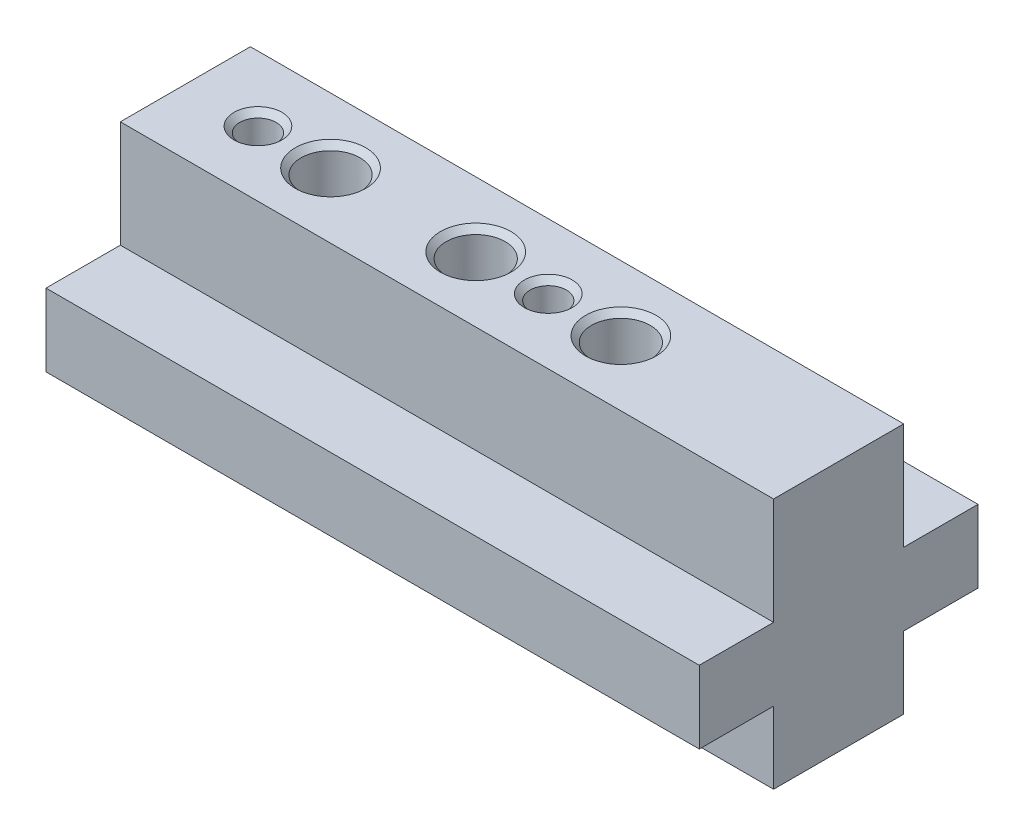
from build123d import *

# Parameters (mm, degrees)
EXTRUDE1_DEPTH            = 28.575
F_5_40_TAPPED_HOLE1_D     = 2.5781
F_5_40_TAPPED_HOLE1_DEPTH = 6.6802
F_5_40_TAPPED_HOLE1_TIP   = 0.774539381
HOLE1_D                   = 1.5875
HOLE1_DEPTH               = 3.175
HOLE1_TIP                 = 0.476933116
CHAMFER1_SIZE             = 0.254


with BuildPart() as part:
    # Sketch1 → Extrude1 (new body)
    with BuildSketch(Plane(origin=(0, 0, 0), x_dir=(0, 0, -1), z_dir=(1, 0, 0))):
        Polygon((-6.096, 1.5875), (-6.096, -1.5875), (-2.8448, -1.5875), (-2.8448, -4.7371), (2.8448, -4.7371), (2.8448, -1.5875), (6.096, -1.5875), (6.096, 1.5875), (2.8448, 1.5875), (2.8448, 6.2611), (-2.8448, 6.2611), (-2.8448, 1.5875), align=None)
    extrude(amount=EXTRUDE1_DEPTH)

    # 5-40 Tapped Hole1
    with Locations(Plane(origin=(0, 6.2611, 0), x_dir=(-1, 0, 0), z_dir=(0, 1, 0))):
        with Locations((-6.35, 0), (-12.7, 0), (-19.05, 0)):
            Hole(F_5_40_TAPPED_HOLE1_D / 2, depth=F_5_40_TAPPED_HOLE1_DEPTH)
            with Locations((0, 0, -(F_5_40_TAPPED_HOLE1_DEPTH + F_5_40_TAPPED_HOLE1_TIP / 2))):  # 118° drill point
                Cone(0, F_5_40_TAPPED_HOLE1_D / 2, F_5_40_TAPPED_HOLE1_TIP, mode=Mode.SUBTRACT)

    # Hole1
    with Locations(Plane(origin=(0, 6.2611, 0), x_dir=(-1, 0, 0), z_dir=(0, 1, 0))):
        with Locations((-3.175, 0), (-15.875, 0)):
            Hole(HOLE1_D / 2, depth=HOLE1_DEPTH)
            with Locations((0, 0, -(HOLE1_DEPTH + HOLE1_TIP / 2))):  # 118° drill point
                Cone(0, HOLE1_D / 2, HOLE1_TIP, mode=Mode.SUBTRACT)

    # Chamfer1
    chamfer1_edges = [part.edges().sort_by_distance(p)[0] for p in [
        (17.76095, 6.2611, 0),
        (11.41095, 6.2611, 0),
        (5.06095, 6.2611, 0),
        (15.08125, 6.2611, 0),
        (2.38125, 6.2611, 0),
    ]]
    chamfer(chamfer1_edges, length=CHAMFER1_SIZE)


solid = part.part
